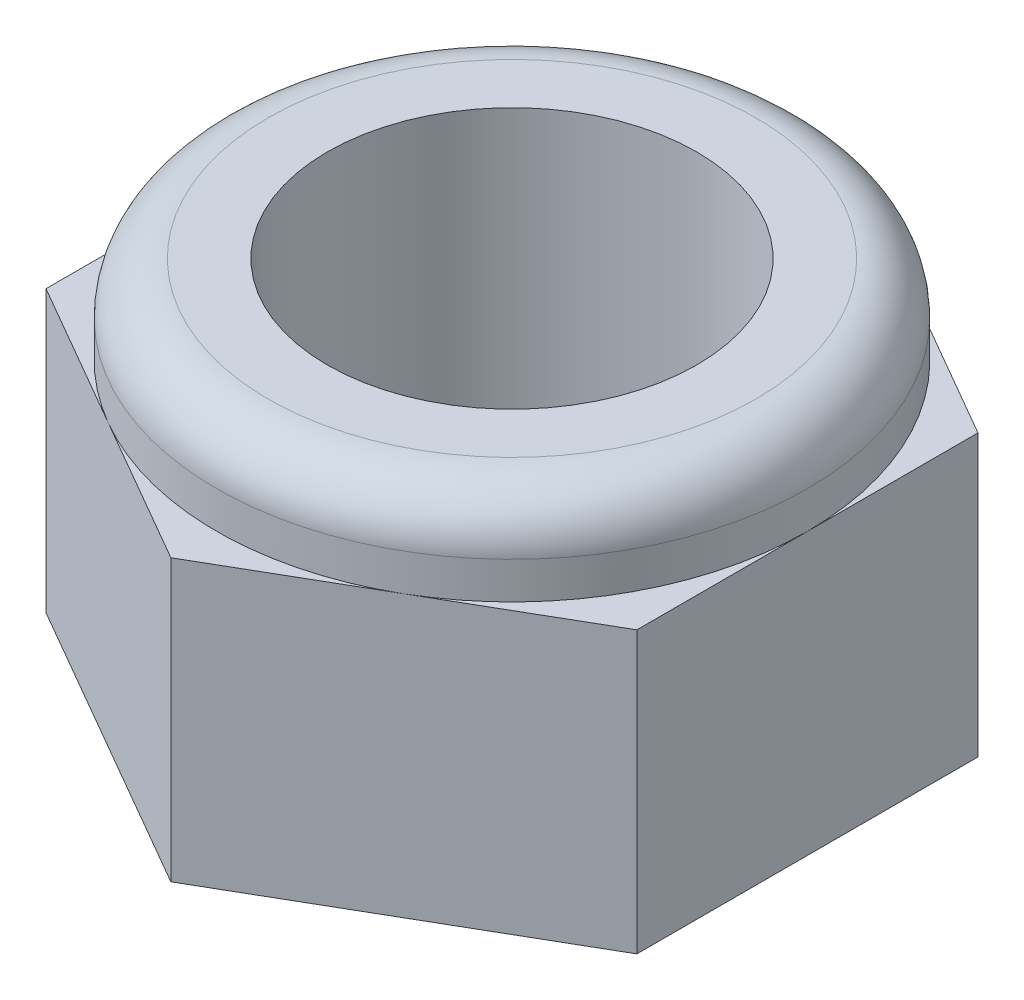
from build123d import *

# Parameters (mm, degrees)
BOSS_EXTRU_1_DEPTH      = 3.8
ESQUISSE3_R             = 2.5
ENL_V_MAT_EXTRU_1_DEPTH = 8.895146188


with BuildPart() as part:
    # Esquisse1 → Boss.-Extru.1 (new body)
    with BuildSketch(Plane(origin=(0, 0, 0), x_dir=(1, 0, 0), z_dir=(0, 1, 0))):
        Polygon((4, -2.309401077), (4, 2.309401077), (0, 4.618802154), (-4, 2.309401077), (-4, -2.309401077), (0, -4.618802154), align=None)
    extrude(amount=BOSS_EXTRU_1_DEPTH)

    # Esquisse2 → R_volution1 (revolve)
    with BuildSketch(Plane.XY, mode=Mode.PRIVATE) as r_volution1_sk:
        with BuildLine():
            Line((-4, 3.8), (0, 3.8))
            Line((0, 3.8), (0, 5))
            Line((0, 5), (-3.3, 5))
            ThreePointArc((-3.3, 5), (-3.794974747, 4.794974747), (-4, 4.3))
            Line((-4, 4.3), (-4, 3.8))
        make_face()
    revolve(r_volution1_sk.sketch.rotate(Axis((0, 3.8, 0), (0, 1, 0)), 180), axis=Axis((0, 3.8, 0), (0, 1, 0)))

    # Esquisse3 → Enl_v. mat.-Extru.1 (cut, through all)
    with BuildSketch(Plane.XZ):
        with Locations(Location((0, 0, 0), (0, 0, 270))):
            Circle(ESQUISSE3_R)
    extrude(amount=-ENL_V_MAT_EXTRU_1_DEPTH, mode=Mode.SUBTRACT)


solid = part.part
